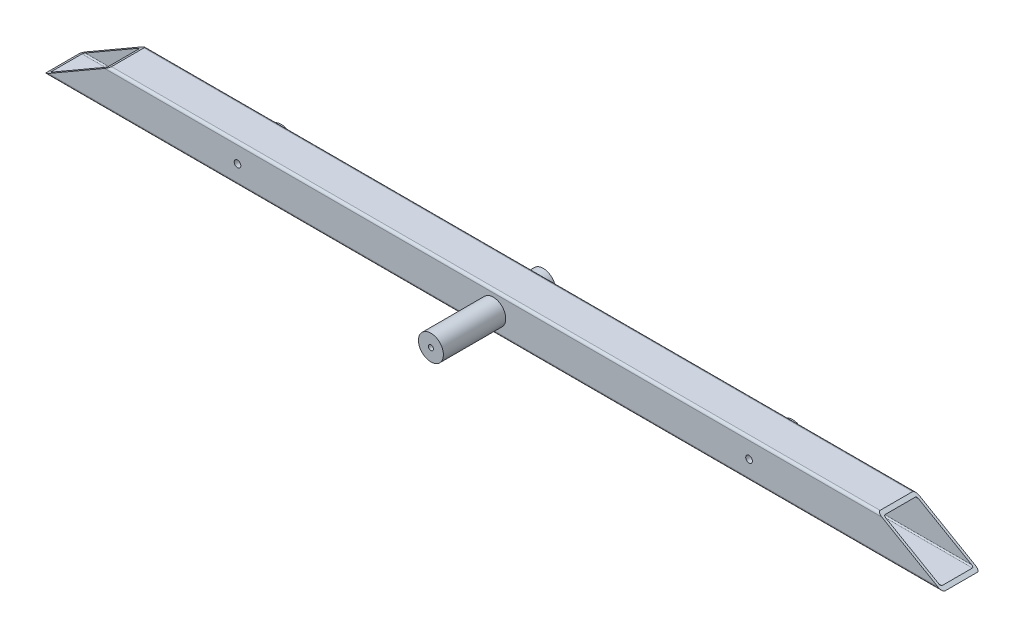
from build123d import *

# Parameters (mm, degrees)
BOSS_EXTRUDE1_DEPTH         = 457.2
CUT_EXTRUDE1_DEPTH          = 25.4
SKETCH3_R                   = 12.7
BOSS_EXTRUDE2_DEPTH         = 82.55
BOSS_EXTRUDE3_START         = -31.75
SKETCH4_R                   = 12.7
BOSS_EXTRUDE3_DEPTH         = 31.75
F_3_8_16_TAPPED_HOLE1_D     = 7.9375
F_3_8_16_TAPPED_HOLE1_DEPTH = 27.0002
F_3_8_16_TAPPED_HOLE1_TIP   = 2.384665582
F_1_4_20_TAPPED_HOLE1_D     = 5.1054
F_1_4_20_TAPPED_HOLE1_DEPTH = 19.05
F_1_4_20_TAPPED_HOLE1_TIP   = 1.533816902
SKETCH9_R                   = 12.7
BOSS_EXTRUDE4_DEPTH         = 44.45
F_1_4_CLEARANCE_HOLE1_D     = 6.7564


with BuildPart() as part:
    # Sketch1 → Boss-Extrude1 (new, symmetric)
    with BuildSketch(Plane(origin=(0, 0, 0), x_dir=(0, 0, -1), z_dir=(1, 0, 0))):
        with BuildLine():
            Line((-16.51, 19.05), (16.51, 19.05))
            ThreePointArc((16.51, 19.05), (18.306051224, 18.306051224), (19.05, 16.51))
            Line((19.05, 16.51), (19.05, -16.51))
            ThreePointArc((19.05, -16.51), (18.306051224, -18.306051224), (16.51, -19.05))
            Line((16.51, -19.05), (-16.51, -19.05))
            ThreePointArc((-16.51, -19.05), (-18.306051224, -18.306051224), (-19.05, -16.51))
            Line((-19.05, -16.51), (-19.05, 16.51))
            ThreePointArc((-19.05, 16.51), (-18.306051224, 18.306051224), (-16.51, 19.05))
        make_face()
        with BuildLine():
            Line((-15.494, 16.764), (15.494, 16.764))
            ThreePointArc((15.494, 16.764), (16.392025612, 16.392025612), (16.764, 15.494))
            Line((16.764, 15.494), (16.764, -15.494))
            ThreePointArc((16.764, -15.494), (16.392025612, -16.392025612), (15.494, -16.764))
            Line((15.494, -16.764), (-15.494, -16.764))
            ThreePointArc((-15.494, -16.764), (-16.392025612, -16.392025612), (-16.764, -15.494))
            Line((-16.764, -15.494), (-16.764, 15.494))
            ThreePointArc((-16.764, 15.494), (-16.392025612, 16.392025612), (-15.494, 16.764))
        make_face(mode=Mode.SUBTRACT)
    extrude(amount=BOSS_EXTRUDE1_DEPTH, both=True)

    # Sketch2 → Cut-Extrude1 (cut, symmetric)
    with BuildSketch(Plane.XY):
        Polygon((391.208864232, 19.05), (457.2, -19.05), (457.2, 19.05), align=None)
    cut_extrude1 = extrude(amount=CUT_EXTRUDE1_DEPTH, both=True, mode=Mode.SUBTRACT)

    # Mirror1: Cut-Extrude1 across plane
    add(cut_extrude1.mirror(Plane(origin=(0, 0, 0), x_dir=(0, 0, 1), z_dir=(1, 0, 0))), mode=Mode.SUBTRACT)

    # Sketch3 → Boss-Extrude2 (add)
    with BuildSketch(Plane.XY):
        with Locations(Location((0, 0, 0), (0, 0, 180))):
            Circle(SKETCH3_R)
    extrude(amount=BOSS_EXTRUDE2_DEPTH)

    # Sketch4 → Boss-Extrude3 (add)
    with BuildSketch(Plane.XY.offset(BOSS_EXTRUDE3_START)):
        with Locations(Location((0, 0, 0), (0, 0, 180))):
            Circle(SKETCH4_R)
    extrude(amount=BOSS_EXTRUDE3_DEPTH)

    # 3_8-16 Tapped Hole1
    with Locations(Plane(origin=(0, 0, -31.75), x_dir=(-1, 0, 0), z_dir=(0, 0, -1))):
        with Locations((0, 0)):
            Hole(F_3_8_16_TAPPED_HOLE1_D / 2, depth=F_3_8_16_TAPPED_HOLE1_DEPTH)
            with Locations((0, 0, -(F_3_8_16_TAPPED_HOLE1_DEPTH + F_3_8_16_TAPPED_HOLE1_TIP / 2))):  # 118° drill point
                Cone(0, F_3_8_16_TAPPED_HOLE1_D / 2, F_3_8_16_TAPPED_HOLE1_TIP, mode=Mode.SUBTRACT)

    # 1_4-20 Tapped Hole1
    with Locations(Plane.XY.offset(82.55)):
        with Locations((0, 0)):
            Hole(F_1_4_20_TAPPED_HOLE1_D / 2, depth=F_1_4_20_TAPPED_HOLE1_DEPTH)
            with Locations((0, 0, -(F_1_4_20_TAPPED_HOLE1_DEPTH + F_1_4_20_TAPPED_HOLE1_TIP / 2))):  # 118° drill point
                Cone(0, F_1_4_20_TAPPED_HOLE1_D / 2, F_1_4_20_TAPPED_HOLE1_TIP, mode=Mode.SUBTRACT)

    # Sketch9 → Boss-Extrude4 (add)
    with BuildSketch(Plane.XY.offset(19.05)):
        with Locations(Location((-260.35, 0, 0), (0, 0, 270))):
            Circle(SKETCH9_R)
        with Locations(Location((260.35, 0, 0), (0, 0, 270))):
            Circle(SKETCH9_R)
    extrude(amount=-BOSS_EXTRUDE4_DEPTH)

    # 1_4 Clearance Hole1 (through all)
    with Locations(Plane(origin=(0, 0, -25.4), x_dir=(-1, 0, 0), z_dir=(0, 0, -1))):
        with Locations((-260.35, 0), (260.35, 0)):
            Hole(F_1_4_CLEARANCE_HOLE1_D / 2)


solid = part.part
